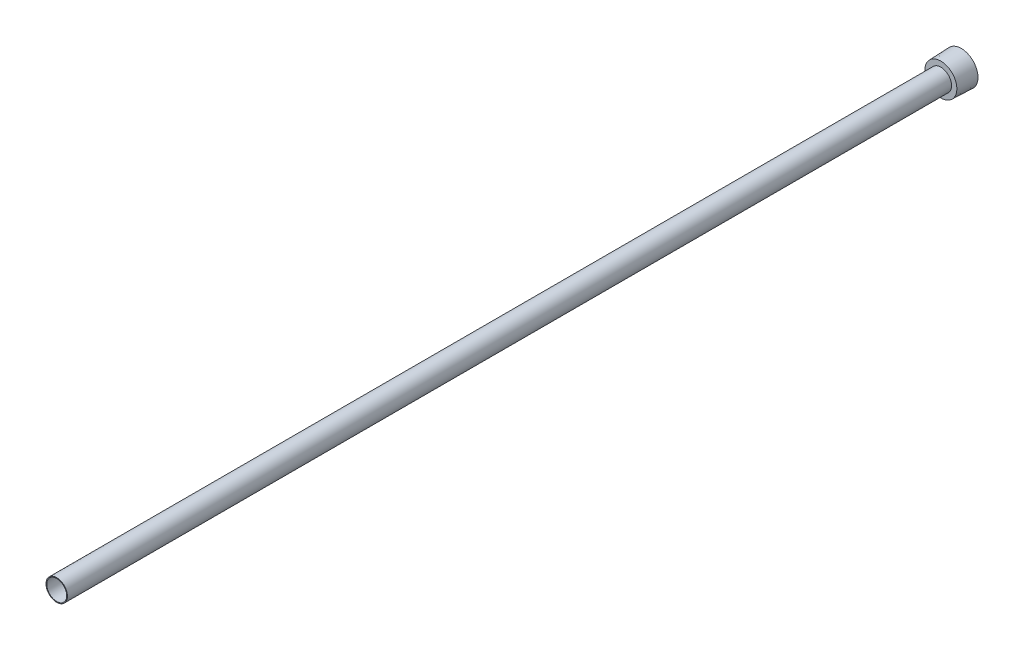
ISO-10303-21;
HEADER;
FILE_DESCRIPTION(('STEP AP214'),'2;1');
FILE_NAME('part.step','',(''),(''),'','','');
FILE_SCHEMA(('AUTOMOTIVE_DESIGN { 1 0 10303 214 1 1 1 1 }'));
ENDSEC;
DATA;
#1=APPLICATION_CONTEXT('core data for automotive mechanical design processes');
#2=APPLICATION_PROTOCOL_DEFINITION('international standard','automotive_design',2000,#1);
#3=PRODUCT_CONTEXT('',#1,'mechanical');
#4=PRODUCT('Part','Part','',(#3));
#5=PRODUCT_RELATED_PRODUCT_CATEGORY('part','',(#4));
#6=PRODUCT_DEFINITION_FORMATION('','',#4);
#7=PRODUCT_DEFINITION_CONTEXT('part definition',#1,'design');
#8=PRODUCT_DEFINITION('design','',#6,#7);
#9=PRODUCT_DEFINITION_SHAPE('','',#8);
#10=(LENGTH_UNIT() NAMED_UNIT(*) SI_UNIT(.MILLI.,.METRE.));
#11=(NAMED_UNIT(*) PLANE_ANGLE_UNIT() SI_UNIT($,.RADIAN.));
#12=(NAMED_UNIT(*) SI_UNIT($,.STERADIAN.) SOLID_ANGLE_UNIT());
#13=UNCERTAINTY_MEASURE_WITH_UNIT(LENGTH_MEASURE(1.E-05),#10,'distance_accuracy_value','');
#14=(GEOMETRIC_REPRESENTATION_CONTEXT(3) GLOBAL_UNCERTAINTY_ASSIGNED_CONTEXT((#13)) GLOBAL_UNIT_ASSIGNED_CONTEXT((#10,
#11,#12)) REPRESENTATION_CONTEXT('',''));
#15=CARTESIAN_POINT('',(0.,0.,0.));
#16=DIRECTION('',(0.,0.,1.));
#17=DIRECTION('',(1.,0.,0.));
#18=AXIS2_PLACEMENT_3D('',#15,#16,#17);
#19=CARTESIAN_POINT('',(0.,0.,0.));
#20=DIRECTION('',(0.,0.,1.));
#21=DIRECTION('',(1.,0.,0.));
#22=AXIS2_PLACEMENT_3D('',#19,#20,#21);
#23=CYLINDRICAL_SURFACE('',#22,5.0419);
#24=CARTESIAN_POINT('',(0.,0.,457.2));
#25=DIRECTION('',(0.,0.,1.));
#26=DIRECTION('',(1.,0.,0.));
#27=AXIS2_PLACEMENT_3D('',#24,#25,#26);
#28=CIRCLE('',#27,5.0419);
#29=CARTESIAN_POINT('',(5.0419,0.,457.2));
#30=VERTEX_POINT('',#29);
#31=EDGE_CURVE('E142',#30,#30,#28,.T.);
#32=ORIENTED_EDGE('',*,*,#31,.T.);
#33=EDGE_LOOP('',(#32));
#34=FACE_BOUND('',#33,.T.);
#35=CARTESIAN_POINT('',(0.,0.,6.35));
#36=DIRECTION('',(0.,0.,-1.));
#37=DIRECTION('',(-1.,0.,0.));
#38=AXIS2_PLACEMENT_3D('',#35,#36,#37);
#39=CIRCLE('',#38,5.0419);
#40=CARTESIAN_POINT('',(-5.0419,0.,6.35));
#41=VERTEX_POINT('',#40);
#42=EDGE_CURVE('E37',#41,#41,#39,.F.);
#43=ORIENTED_EDGE('',*,*,#42,.F.);
#44=EDGE_LOOP('',(#43));
#45=FACE_BOUND('',#44,.T.);
#46=ADVANCED_FACE('F33',(#34,#45),#23,.F.);
#47=CARTESIAN_POINT('',(0.,0.,0.));
#48=DIRECTION('',(0.,0.,-1.));
#49=DIRECTION('',(-1.,0.,0.));
#50=AXIS2_PLACEMENT_3D('',#47,#48,#49);
#51=CONICAL_SURFACE('',#50,8.4709,0.0364599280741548);
#52=CARTESIAN_POINT('',(0.,0.,10.3124));
#53=DIRECTION('',(0.,0.,1.));
#54=DIRECTION('',(1.,0.,0.));
#55=AXIS2_PLACEMENT_3D('',#52,#53,#54);
#56=CIRCLE('',#55,8.09474394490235);
#57=CARTESIAN_POINT('',(8.09474394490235,0.,10.3124));
#58=VERTEX_POINT('',#57);
#59=EDGE_CURVE('E11',#58,#58,#56,.T.);
#60=ORIENTED_EDGE('',*,*,#59,.F.);
#61=EDGE_LOOP('',(#60));
#62=FACE_BOUND('',#61,.T.);
#63=CARTESIAN_POINT('',(0.,0.,0.));
#64=DIRECTION('',(0.,0.,1.));
#65=DIRECTION('',(1.,0.,0.));
#66=AXIS2_PLACEMENT_3D('',#63,#64,#65);
#67=CIRCLE('',#66,8.4709);
#68=CARTESIAN_POINT('',(8.4709,0.,0.));
#69=VERTEX_POINT('',#68);
#70=EDGE_CURVE('E145',#69,#69,#67,.T.);
#71=ORIENTED_EDGE('',*,*,#70,.T.);
#72=EDGE_LOOP('',(#71));
#73=FACE_BOUND('',#72,.T.);
#74=ADVANCED_FACE('F35',(#62,#73),#51,.T.);
#75=CARTESIAN_POINT('',(0.,8.09474394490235,10.3124));
#76=DIRECTION('',(0.,0.,-1.));
#77=DIRECTION('',(-1.,0.,0.));
#78=AXIS2_PLACEMENT_3D('',#75,#76,#77);
#79=PLANE('',#78);
#80=CARTESIAN_POINT('',(0.,0.,10.3124));
#81=DIRECTION('',(0.,0.,1.));
#82=DIRECTION('',(1.,0.,0.));
#83=AXIS2_PLACEMENT_3D('',#80,#81,#82);
#84=CIRCLE('',#83,5.4229);
#85=CARTESIAN_POINT('',(5.4229,0.,10.3124));
#86=VERTEX_POINT('',#85);
#87=EDGE_CURVE('E42',#86,#86,#84,.T.);
#88=ORIENTED_EDGE('',*,*,#87,.F.);
#89=EDGE_LOOP('',(#88));
#90=FACE_BOUND('',#89,.T.);
#91=ORIENTED_EDGE('',*,*,#59,.T.);
#92=EDGE_LOOP('',(#91));
#93=FACE_BOUND('',#92,.T.);
#94=ADVANCED_FACE('F156',(#90,#93),#79,.F.);
#95=CARTESIAN_POINT('',(0.,0.,168.793426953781));
#96=DIRECTION('',(0.,0.,1.));
#97=DIRECTION('',(1.,0.,0.));
#98=AXIS2_PLACEMENT_3D('',#95,#96,#97);
#99=CYLINDRICAL_SURFACE('',#98,5.42289999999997);
#100=CARTESIAN_POINT('',(0.,0.,457.2));
#101=DIRECTION('',(0.,0.,1.));
#102=DIRECTION('',(1.,0.,0.));
#103=AXIS2_PLACEMENT_3D('',#100,#101,#102);
#104=CIRCLE('',#103,5.42289999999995);
#105=CARTESIAN_POINT('',(5.42289999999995,0.,457.2));
#106=VERTEX_POINT('',#105);
#107=EDGE_CURVE('E148',#106,#106,#104,.T.);
#108=ORIENTED_EDGE('',*,*,#107,.F.);
#109=EDGE_LOOP('',(#108));
#110=FACE_BOUND('',#109,.T.);
#111=ORIENTED_EDGE('',*,*,#87,.T.);
#112=EDGE_LOOP('',(#111));
#113=FACE_BOUND('',#112,.T.);
#114=ADVANCED_FACE('F154',(#110,#113),#99,.T.);
#115=CARTESIAN_POINT('',(0.,5.42289999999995,457.2));
#116=DIRECTION('',(0.,0.,-1.));
#117=DIRECTION('',(-1.,0.,0.));
#118=AXIS2_PLACEMENT_3D('',#115,#116,#117);
#119=PLANE('',#118);
#120=ORIENTED_EDGE('',*,*,#31,.F.);
#121=EDGE_LOOP('',(#120));
#122=FACE_BOUND('',#121,.T.);
#123=ORIENTED_EDGE('',*,*,#107,.T.);
#124=EDGE_LOOP('',(#123));
#125=FACE_BOUND('',#124,.T.);
#126=ADVANCED_FACE('F167',(#122,#125),#119,.F.);
#127=CARTESIAN_POINT('',(0.,0.,0.));
#128=DIRECTION('',(0.,0.,1.));
#129=DIRECTION('',(1.,0.,0.));
#130=AXIS2_PLACEMENT_3D('',#127,#128,#129);
#131=PLANE('',#130);
#132=DIRECTION('',(-0.866025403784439,0.5,0.));
#133=VECTOR('',#132,1.);
#134=CARTESIAN_POINT('',(0.,-6.41580486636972,0.));
#135=LINE('',#134,#133);
#136=CARTESIAN_POINT('',(0.,-6.41580486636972,0.));
#137=VERTEX_POINT('',#136);
#138=CARTESIAN_POINT('',(-5.55625,-3.20790243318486,0.));
#139=VERTEX_POINT('',#138);
#140=EDGE_CURVE('E124',#137,#139,#135,.T.);
#141=ORIENTED_EDGE('',*,*,#140,.F.);
#142=DIRECTION('',(-0.866025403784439,-0.5,0.));
#143=VECTOR('',#142,1.);
#144=CARTESIAN_POINT('',(5.55625,-3.20790243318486,0.));
#145=LINE('',#144,#143);
#146=CARTESIAN_POINT('',(5.55625,-3.20790243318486,0.));
#147=VERTEX_POINT('',#146);
#148=EDGE_CURVE('E49',#147,#137,#145,.T.);
#149=ORIENTED_EDGE('',*,*,#148,.F.);
#150=DIRECTION('',(0.,-1.,0.));
#151=VECTOR('',#150,1.);
#152=CARTESIAN_POINT('',(5.55625,3.20790243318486,0.));
#153=LINE('',#152,#151);
#154=CARTESIAN_POINT('',(5.55625,3.20790243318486,0.));
#155=VERTEX_POINT('',#154);
#156=EDGE_CURVE('E133',#155,#147,#153,.T.);
#157=ORIENTED_EDGE('',*,*,#156,.F.);
#158=DIRECTION('',(0.866025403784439,-0.5,0.));
#159=VECTOR('',#158,1.);
#160=CARTESIAN_POINT('',(0.,6.41580486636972,0.));
#161=LINE('',#160,#159);
#162=CARTESIAN_POINT('',(0.,6.41580486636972,0.));
#163=VERTEX_POINT('',#162);
#164=EDGE_CURVE('E131',#163,#155,#161,.T.);
#165=ORIENTED_EDGE('',*,*,#164,.F.);
#166=DIRECTION('',(0.866025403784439,0.5,0.));
#167=VECTOR('',#166,1.);
#168=CARTESIAN_POINT('',(-5.55625,3.20790243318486,0.));
#169=LINE('',#168,#167);
#170=CARTESIAN_POINT('',(-5.55625,3.20790243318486,0.));
#171=VERTEX_POINT('',#170);
#172=EDGE_CURVE('E97',#171,#163,#169,.T.);
#173=ORIENTED_EDGE('',*,*,#172,.F.);
#174=DIRECTION('',(0.,1.,0.));
#175=VECTOR('',#174,1.);
#176=CARTESIAN_POINT('',(-5.55625,-3.20790243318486,0.));
#177=LINE('',#176,#175);
#178=EDGE_CURVE('E127',#139,#171,#177,.T.);
#179=ORIENTED_EDGE('',*,*,#178,.F.);
#180=EDGE_LOOP('',(#141,#149,#157,#165,#173,#179));
#181=FACE_BOUND('',#180,.T.);
#182=ORIENTED_EDGE('',*,*,#70,.F.);
#183=EDGE_LOOP('',(#182));
#184=FACE_BOUND('',#183,.T.);
#185=ADVANCED_FACE('F165',(#181,#184),#131,.F.);
#186=CARTESIAN_POINT('',(0.,-6.41580486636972,6.35));
#187=DIRECTION('',(0.,0.,-1.));
#188=DIRECTION('',(-1.,0.,0.));
#189=AXIS2_PLACEMENT_3D('',#186,#187,#188);
#190=PLANE('',#189);
#191=DIRECTION('',(-0.866025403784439,-0.5,0.));
#192=VECTOR('',#191,1.);
#193=CARTESIAN_POINT('',(5.55625,-3.20790243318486,6.35));
#194=LINE('',#193,#192);
#195=CARTESIAN_POINT('',(5.55625,-3.20790243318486,6.35));
#196=VERTEX_POINT('',#195);
#197=CARTESIAN_POINT('',(0.,-6.41580486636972,6.35));
#198=VERTEX_POINT('',#197);
#199=EDGE_CURVE('E135',#196,#198,#194,.T.);
#200=ORIENTED_EDGE('',*,*,#199,.T.);
#201=DIRECTION('',(-0.866025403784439,0.5,0.));
#202=VECTOR('',#201,1.);
#203=CARTESIAN_POINT('',(0.,-6.41580486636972,6.35));
#204=LINE('',#203,#202);
#205=CARTESIAN_POINT('',(-5.55625,-3.20790243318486,6.35));
#206=VERTEX_POINT('',#205);
#207=EDGE_CURVE('E118',#198,#206,#204,.T.);
#208=ORIENTED_EDGE('',*,*,#207,.T.);
#209=DIRECTION('',(0.,1.,0.));
#210=VECTOR('',#209,1.);
#211=CARTESIAN_POINT('',(-5.55625,-3.20790243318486,6.35));
#212=LINE('',#211,#210);
#213=CARTESIAN_POINT('',(-5.55625,3.20790243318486,6.35));
#214=VERTEX_POINT('',#213);
#215=EDGE_CURVE('E116',#206,#214,#212,.T.);
#216=ORIENTED_EDGE('',*,*,#215,.T.);
#217=DIRECTION('',(0.866025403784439,0.5,0.));
#218=VECTOR('',#217,1.);
#219=CARTESIAN_POINT('',(-5.55625,3.20790243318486,6.35));
#220=LINE('',#219,#218);
#221=CARTESIAN_POINT('',(0.,6.41580486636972,6.35));
#222=VERTEX_POINT('',#221);
#223=EDGE_CURVE('E94',#214,#222,#220,.T.);
#224=ORIENTED_EDGE('',*,*,#223,.T.);
#225=DIRECTION('',(0.866025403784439,-0.5,0.));
#226=VECTOR('',#225,1.);
#227=CARTESIAN_POINT('',(0.,6.41580486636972,6.35));
#228=LINE('',#227,#226);
#229=CARTESIAN_POINT('',(5.55625,3.20790243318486,6.35));
#230=VERTEX_POINT('',#229);
#231=EDGE_CURVE('E105',#222,#230,#228,.T.);
#232=ORIENTED_EDGE('',*,*,#231,.T.);
#233=DIRECTION('',(0.,-1.,0.));
#234=VECTOR('',#233,1.);
#235=CARTESIAN_POINT('',(5.55625,3.20790243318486,6.35));
#236=LINE('',#235,#234);
#237=EDGE_CURVE('E109',#230,#196,#236,.T.);
#238=ORIENTED_EDGE('',*,*,#237,.T.);
#239=EDGE_LOOP('',(#200,#208,#216,#224,#232,#238));
#240=FACE_BOUND('',#239,.T.);
#241=ORIENTED_EDGE('',*,*,#42,.T.);
#242=EDGE_LOOP('',(#241));
#243=FACE_BOUND('',#242,.T.);
#244=ADVANCED_FACE('F112',(#240,#243),#190,.T.);
#245=CARTESIAN_POINT('',(5.55625,-3.20790243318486,6.35));
#246=DIRECTION('',(0.5,-0.866025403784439,0.));
#247=DIRECTION('',(0.866025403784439,0.5,0.));
#248=AXIS2_PLACEMENT_3D('',#245,#246,#247);
#249=PLANE('',#248);
#250=ORIENTED_EDGE('',*,*,#148,.T.);
#251=DIRECTION('',(0.,0.,-1.));
#252=VECTOR('',#251,1.);
#253=CARTESIAN_POINT('',(0.,-6.41580486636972,6.35));
#254=LINE('',#253,#252);
#255=EDGE_CURVE('E79',#198,#137,#254,.T.);
#256=ORIENTED_EDGE('',*,*,#255,.F.);
#257=ORIENTED_EDGE('',*,*,#199,.F.);
#258=DIRECTION('',(0.,0.,-1.));
#259=VECTOR('',#258,1.);
#260=CARTESIAN_POINT('',(5.55625,-3.20790243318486,6.35));
#261=LINE('',#260,#259);
#262=EDGE_CURVE('E57',#196,#147,#261,.T.);
#263=ORIENTED_EDGE('',*,*,#262,.T.);
#264=EDGE_LOOP('',(#250,#256,#257,#263));
#265=FACE_BOUND('',#264,.T.);
#266=ADVANCED_FACE('F174',(#265),#249,.F.);
#267=CARTESIAN_POINT('',(5.55625,3.20790243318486,6.35));
#268=DIRECTION('',(1.,0.,0.));
#269=DIRECTION('',(0.,0.,-1.));
#270=AXIS2_PLACEMENT_3D('',#267,#268,#269);
#271=PLANE('',#270);
#272=ORIENTED_EDGE('',*,*,#156,.T.);
#273=ORIENTED_EDGE('',*,*,#262,.F.);
#274=ORIENTED_EDGE('',*,*,#237,.F.);
#275=DIRECTION('',(0.,0.,-1.));
#276=VECTOR('',#275,1.);
#277=CARTESIAN_POINT('',(5.55625,3.20790243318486,6.35));
#278=LINE('',#277,#276);
#279=EDGE_CURVE('E101',#230,#155,#278,.T.);
#280=ORIENTED_EDGE('',*,*,#279,.T.);
#281=EDGE_LOOP('',(#272,#273,#274,#280));
#282=FACE_BOUND('',#281,.T.);
#283=ADVANCED_FACE('F188',(#282),#271,.F.);
#284=CARTESIAN_POINT('',(0.,6.41580486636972,6.35));
#285=DIRECTION('',(0.5,0.866025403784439,0.));
#286=DIRECTION('',(-0.866025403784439,0.5,0.));
#287=AXIS2_PLACEMENT_3D('',#284,#285,#286);
#288=PLANE('',#287);
#289=ORIENTED_EDGE('',*,*,#164,.T.);
#290=ORIENTED_EDGE('',*,*,#279,.F.);
#291=ORIENTED_EDGE('',*,*,#231,.F.);
#292=DIRECTION('',(0.,0.,-1.));
#293=VECTOR('',#292,1.);
#294=CARTESIAN_POINT('',(0.,6.41580486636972,6.35));
#295=LINE('',#294,#293);
#296=EDGE_CURVE('E90',#222,#163,#295,.T.);
#297=ORIENTED_EDGE('',*,*,#296,.T.);
#298=EDGE_LOOP('',(#289,#290,#291,#297));
#299=FACE_BOUND('',#298,.T.);
#300=ADVANCED_FACE('F106',(#299),#288,.F.);
#301=CARTESIAN_POINT('',(-5.55625,3.20790243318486,6.35));
#302=DIRECTION('',(-0.5,0.866025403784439,0.));
#303=DIRECTION('',(-0.866025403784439,-0.5,0.));
#304=AXIS2_PLACEMENT_3D('',#301,#302,#303);
#305=PLANE('',#304);
#306=ORIENTED_EDGE('',*,*,#172,.T.);
#307=ORIENTED_EDGE('',*,*,#296,.F.);
#308=ORIENTED_EDGE('',*,*,#223,.F.);
#309=DIRECTION('',(0.,0.,-1.));
#310=VECTOR('',#309,1.);
#311=CARTESIAN_POINT('',(-5.55625,3.20790243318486,6.35));
#312=LINE('',#311,#310);
#313=EDGE_CURVE('E102',#214,#171,#312,.T.);
#314=ORIENTED_EDGE('',*,*,#313,.T.);
#315=EDGE_LOOP('',(#306,#307,#308,#314));
#316=FACE_BOUND('',#315,.T.);
#317=ADVANCED_FACE('F92',(#316),#305,.F.);
#318=CARTESIAN_POINT('',(-5.55625,-3.20790243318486,6.35));
#319=DIRECTION('',(-1.,0.,0.));
#320=DIRECTION('',(0.,0.,1.));
#321=AXIS2_PLACEMENT_3D('',#318,#319,#320);
#322=PLANE('',#321);
#323=ORIENTED_EDGE('',*,*,#178,.T.);
#324=ORIENTED_EDGE('',*,*,#313,.F.);
#325=ORIENTED_EDGE('',*,*,#215,.F.);
#326=DIRECTION('',(0.,0.,-1.));
#327=VECTOR('',#326,1.);
#328=CARTESIAN_POINT('',(-5.55625,-3.20790243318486,6.35));
#329=LINE('',#328,#327);
#330=EDGE_CURVE('E139',#206,#139,#329,.T.);
#331=ORIENTED_EDGE('',*,*,#330,.T.);
#332=EDGE_LOOP('',(#323,#324,#325,#331));
#333=FACE_BOUND('',#332,.T.);
#334=ADVANCED_FACE('F192',(#333),#322,.F.);
#335=CARTESIAN_POINT('',(0.,-6.41580486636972,6.35));
#336=DIRECTION('',(-0.5,-0.866025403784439,0.));
#337=DIRECTION('',(0.866025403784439,-0.5,0.));
#338=AXIS2_PLACEMENT_3D('',#335,#336,#337);
#339=PLANE('',#338);
#340=ORIENTED_EDGE('',*,*,#140,.T.);
#341=ORIENTED_EDGE('',*,*,#330,.F.);
#342=ORIENTED_EDGE('',*,*,#207,.F.);
#343=ORIENTED_EDGE('',*,*,#255,.T.);
#344=EDGE_LOOP('',(#340,#341,#342,#343));
#345=FACE_BOUND('',#344,.T.);
#346=ADVANCED_FACE('F189',(#345),#339,.F.);
#347=CLOSED_SHELL('',(#46,#74,#94,#114,#126,#185,#244,#266,#283,#300,#317,#334,#346));
#348=MANIFOLD_SOLID_BREP('B2',#347);
#349=ADVANCED_BREP_SHAPE_REPRESENTATION('',(#18,#348),#14);
#350=SHAPE_DEFINITION_REPRESENTATION(#9,#349);
ENDSEC;
END-ISO-10303-21;
